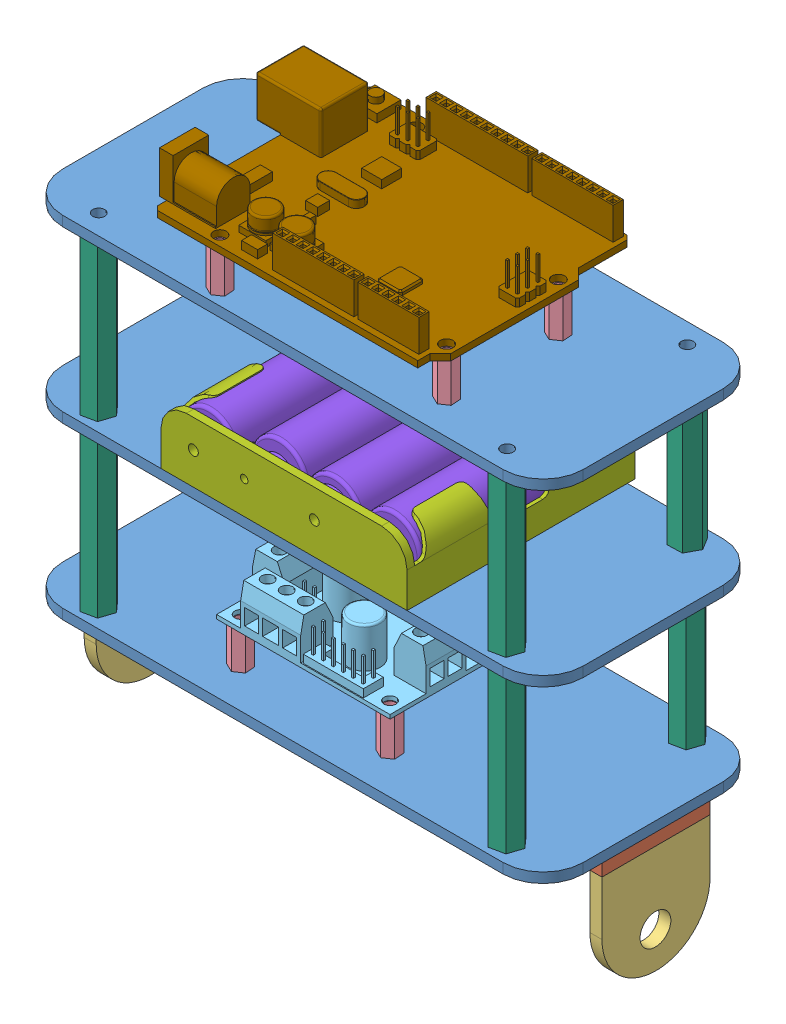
SolidWorks assembly robot.SLDASM, configuration Default (file format 9000). Lengths in mm.
Overall size (130 139.6 56.9).
54 component instances, 17 part files, 65 mates.
Components (placement in the parent):
- bed-2.5mm-1: bed-2.5mm.SLDPRT [Default] at (33.0822 58.8238 113.2124) size (130 2.5 55)
- bracket part1-1: bracket part1.SLDPRT [Default] at (-11.9178 55.8238 111.8401) x (0 1 0) z (0 0 1) size (3 40 27)
- bracketpart2-1: bracketpart2.SLDPRT [Default] at (-31.9178 42.3238 111.8401) size (3 27 27)
- bracket part1-2: bracket part1.SLDPRT [Default] at (78.0822 55.8238 112.5269) x (0 1 0) z (0 0 -1) size (3 40 27)
- bracketpart2-2: bracketpart2.SLDPRT [Default] at (95.0822 42.3238 112.5269) size (3 27 27)
- piller-10mm-1: piller-10mm.SLDPRT [Default] at (49.77 71.3238 130.8308) x (1 0 0) z (0 -1 0) size (4.51 5 10)
- piller-10mm-2: piller-10mm.SLDPRT [Default] at (49.77 71.3238 93.5308) x (1 0 0) z (0 -1 0) size (4.51 5 10)
- piller-10mm-3: piller-10mm.SLDPRT [Default] at (87.07 71.3238 130.8308) x (1 0 0) z (0 -1 0) size (4.51 5 10)
- piller-10mm-4: piller-10mm.SLDPRT [Default] at (87.07 71.3238 93.5308) x (1 0 0) z (0 -1 0) size (4.51 5 10)
- L298N-1: L298N.SLDPRT [Predeterminado] at (52.9557 71.3238 90.5308) size (43.3 25 43.3)
- piller-40mm-1: piller-40mm.SLDPRT [Default] at (-17.9178 61.3238 90.7124) size (7.34 40 7.12)
- piller-40mm-2: piller-40mm.SLDPRT [Default] at (84.0822 61.3238 90.7124) size (7.34 40 7.12)
- piller-40mm-3: piller-40mm.SLDPRT [Default] at (-17.9178 61.3238 135.7124) size (7.34 40 7.12)
- piller-40mm-4: piller-40mm.SLDPRT [Default] at (84.0822 61.3238 135.7124) size (7.34 40 7.12)
- bed-2.5mm-2: bed-2.5mm.SLDPRT [Default] at (33.0822 101.3238 113.2124) size (130 2.5 55)
- User Library-R6_AA_UM3-1_5V_holder4AA-1: User Library-R6_AA_UM3-1_5V_holder4AA.SLDPRT [4AA] at (33.3637 103.8238 112.2644) x (0 0 1) z (0 1 0) size (56.9 61.47 15.11)
- Batteria ricaricabile stilo-1: Batteria ricaricabile stilo.SLDPRT [Default] at (55.7792 111.8248 136.1244) x (1 0 0) z (0 0 -1) size (13.97 13.97 50.04)
- Batteria ricaricabile stilo-3: Batteria ricaricabile stilo.SLDPRT [Default] at (40.7932 111.8248 88.4044) x (0.96512 -0.261806 0) z (0 0 1) size (13.97 13.97 50.04)
- Batteria ricaricabile stilo-4: Batteria ricaricabile stilo.SLDPRT [Default] at (25.8707 111.8248 134.6244) x (0.945697 -0.32505 0) z (0 0 -1) size (13.97 13.97 50.04)
- Batteria ricaricabile stilo-5: Batteria ricaricabile stilo.SLDPRT [Default] at (10.5037 111.8248 89.4044) size (13.97 13.97 50.04)
- piller-40mm-5: piller-40mm.SLDPRT [Default] at (-17.9178 103.8238 90.7124) size (7.34 40 7.12)
- piller-40mm-6: piller-40mm.SLDPRT [Default] at (84.0822 103.8238 135.7124) size (7.34 40 7.12)
- piller-40mm-7: piller-40mm.SLDPRT [Default] at (84.0822 103.8238 90.7124) x (0.983984 0 0.178259) z (-0.178259 0 0.983984) size (7.34 40 7.12)
- piller-40mm-8: piller-40mm.SLDPRT [Default] at (-17.9178 103.8238 135.7124) size (7.34 40 7.12)
- bed-2.5mm-3: bed-2.5mm.SLDPRT [Default] at (33.0822 143.8238 113.2124) size (130 2.5 55)
- piller-10mm-5: piller-10mm.SLDPRT [Default] at (51.7887 156.3238 89.1251) x (1 0 0) z (0 -1 0) size (4.51 5 10)
- piller-10mm-6: piller-10mm.SLDPRT [Default] at (102.5887 156.3238 104.3251) x (1 0 0) z (0 -1 0) size (4.51 5 10)
- piller-10mm-7: piller-10mm.SLDPRT [Default] at (102.5887 156.3238 132.2251) x (1 0 0) z (0 -1 0) size (4.51 5 10)
- piller-10mm-8: piller-10mm.SLDPRT [Default] at (50.6887 156.3238 136.9251) x (1 0 0) z (0 -1 0) size (4.51 5 10)
- Arduino UNO-1: Arduino UNO.SLDPRT [Default] at (32.4743 156.3238 112.7751) size (74.8 12.1 53.3)
- MPU 6050 IMU-1: MPU 6050 IMU.SLDASM [Default] at (28.7297 157.964 85.6114)
  - Base-1: Base.SLDPRT [Default] at (7.2489 10.9584 16.5726) (suppressed, hidden)
  - pin header-1: pin header.SLDPRT [Default] at (16.0246 10.3869 9.8416) x (-1 0 0) z (0 0 1) (suppressed, hidden)
  - pin header-2: pin header.SLDPRT [Default] at (13.4846 10.3869 9.8416) x (-1 0 0) z (0 0 1) (suppressed, hidden)
  - pin header-3: pin header.SLDPRT [Default] at (10.9446 10.3869 9.8416) x (-1 0 0) z (0 0 1) (suppressed, hidden)
  - pin header-4: pin header.SLDPRT [Default] at (8.4046 10.3869 9.8416) x (-1 0 0) z (0 0 1) (suppressed, hidden)
  - pin header-5: pin header.SLDPRT [Default] at (5.8646 10.3869 9.8416) x (-1 0 0) z (0 0 1) (suppressed, hidden)
  - pin header-6: pin header.SLDPRT [Default] at (3.3246 10.3869 9.8416) x (-1 0 0) z (0 0 1) (suppressed, hidden)
  - pin header-7: pin header.SLDPRT [Default] at (0.7846 10.3869 9.8416) x (-1 0 0) z (0 0 1) (suppressed, hidden)
  - pin header-8: pin header.SLDPRT [Default] at (-1.7554 10.3869 9.8416) x (-1 0 0) z (0 0 1) (suppressed, hidden)
  - sensor chip-1: sensor chip.SLDPRT [Default] at (7.2489 11.5499 17.4466) (suppressed, hidden)
  - S2NH chip-1: S2NH chip.SLDPRT [Default] at (16.1026 12.3799 16.5726) (suppressed, hidden)
  - Resistor small-3: Resistor small.SLDPRT [Default] at (16.1026 11.5314 19.3726) (suppressed, hidden)
  - Resistor small-4: Resistor small.SLDPRT [Default] at (13.9776 11.5314 15.6976) x (0 0 -1) z (1 0 0) (suppressed, hidden)
  - Resistor small black-3: Resistor small black.SLDPRT [Default] at (12.6276 11.5299 15.6976) x (0 0 1) z (-1 0 0) (suppressed, hidden)
  - Resistor small black-4: Resistor small black.SLDPRT [Default] at (11.1276 11.5299 15.6976) x (0 0 1) z (-1 0 0) (suppressed, hidden)
  - Resistor small-5: Resistor small.SLDPRT [Default] at (12.6276 11.5314 19.3216) x (0 0 -1) z (1 0 0) (suppressed, hidden)
  - Resistor small-6: Resistor small.SLDPRT [Default] at (11.1276 11.5314 19.3216) x (0 0 -1) z (1 0 0) (suppressed, hidden)
  - Resistor small-7: Resistor small.SLDPRT [Default] at (3.3702 11.5314 19.3216) x (0 0 -1) z (1 0 0) (suppressed, hidden)
  - Resistor small black-5: Resistor small black.SLDPRT [Default] at (1.8702 11.5299 15.6968) x (0 0 -1) z (1 0 0) (suppressed, hidden)
  - Resistor small-8: Resistor small.SLDPRT [Default] at (3.3702 11.5314 15.6976) x (0 0 1) z (-1 0 0) (suppressed, hidden)
  - Small LED-1: Small LED.SLDPRT [Default] at (0.3652 11.5299 15.6976) (suppressed, hidden)
  - Resistor small black-6: Resistor small black.SLDPRT [Default] at (1.8702 11.5299 19.3216) x (0 0 1) z (-1 0 0) (suppressed, hidden)
  - Resistor black-1: Resistor black.SLDPRT [Default] at (7.2489 12.3799 21.6466) (suppressed, hidden)
Mates (geometry in assembly coordinates):
- Coincident1: coincident anti-aligned: plane of bed-2.5mm-1 through (33.0822 58.8238 113.2124) normal (0 -1 0); plane of bracket part1-1 through (-11.9178 58.8238 111.8401) normal (0 1 0)
- Coincident2: coincident aligned: plane of bed-2.5mm-1 through (-31.9178 61.3238 85.7124) normal (-1 0 0); plane of bracket part1-1 through (-31.9178 58.8238 125.3401) normal (-1 0 0)
- Coincident3: coincident anti-aligned: plane of bracket part1-1 through (-11.9178 55.8238 111.8401) normal (0 -1 0); plane of bracketpart2-1 through (-28.9178 55.8238 125.3401) normal (0 1 0)
- Coincident4: coincident aligned: plane of bracket part1-1 through (-31.9178 58.8238 125.3401) normal (-1 0 0); plane of bracketpart2-1 through (-31.9178 42.3238 111.8401) normal (-1 0 0)
- Coincident5: coincident aligned: plane of bracket part1-1 through (-31.9178 58.8238 98.3401) normal (0 0 -1); plane of bracketpart2-1 through (-28.9178 55.8238 98.3401) normal (0 0 -1)
- Coincident6: coincident anti-aligned: plane of bed-2.5mm-1 through (33.0822 58.8238 113.2124) normal (0 -1 0); plane of bracket part1-2 through (78.0822 58.8238 112.5269) normal (0 1 0)
- Coincident7: coincident aligned: plane of bed-2.5mm-1 through (98.0822 61.3238 85.7124) normal (1 0 0); plane of bracket part1-2 through (98.0822 58.8238 99.0269) normal (1 0 0)
- Coincident8: coincident anti-aligned: plane of bracket part1-2 through (78.0822 55.8238 112.5269) normal (0 -1 0); plane of bracketpart2-2 through (98.0822 55.8238 126.0269) normal (0 1 0)
- Coincident9: coincident aligned: plane of bracket part1-2 through (98.0822 58.8238 99.0269) normal (1 0 0); plane of bracketpart2-2 through (98.0822 42.3238 112.5269) normal (1 0 0)
- Coincident10: coincident aligned: plane of bracket part1-2 through (98.0822 58.8238 126.0269) normal (0 0 1); plane of bracketpart2-2 through (98.0822 42.3238 126.0269) normal (0 0 1)
- Coincident11: coincident anti-aligned: plane of bed-2.5mm-1 through (33.0822 61.3238 113.2124) normal (0 1 0); plane of piller-10mm-4 through (87.07 61.3238 93.5308) normal (0 -1 0)
- Coincident12: coincident anti-aligned: plane of bed-2.5mm-1 through (33.0822 61.3238 113.2124) normal (0 1 0); plane of piller-10mm-3 through (87.07 61.3238 130.8308) normal (0 -1 0)
- Coincident13: coincident anti-aligned: plane of bed-2.5mm-1 through (33.0822 61.3238 113.2124) normal (0 1 0); plane of piller-10mm-1 through (49.77 61.3238 130.8308) normal (0 -1 0)
- Coincident14: coincident anti-aligned: plane of bed-2.5mm-1 through (33.0822 61.3238 113.2124) normal (0 1 0); plane of piller-10mm-2 through (49.77 61.3238 93.5308) normal (0 -1 0)
- Coincident15: coincident anti-aligned: plane of piller-10mm-1 through (49.77 71.3238 130.8308) normal (0 1 0); plane of L298N-1 through (-16.4657 71.3238 112.1808) normal (0 -1 0)
- Concentric1: concentric anti-aligned: circle of piller-10mm-1; circle of L298N-1
- Concentric2: concentric anti-aligned: circle of piller-10mm-3; circle of L298N-1
- Concentric3: concentric anti-aligned: circle of piller-10mm-4; circle of L298N-1
- Concentric4: concentric anti-aligned: circle of piller-10mm-2; circle of L298N-1
- Coincident16: coincident anti-aligned: plane of bed-2.5mm-1 through (33.0822 61.3238 113.2124) normal (0 1 0); plane of piller-40mm-4 through (84.0822 61.3238 135.7124) normal (0 -1 0)
- Concentric5: concentric anti-aligned: circle of bed-2.5mm-1; circle of piller-40mm-4
- Concentric6: concentric anti-aligned: cylinder of bed-2.5mm-1 through (84.0822 66.8238 90.7124) axis (0 -1 0) radius 1.5; circle of piller-40mm-2
- Coincident17: coincident anti-aligned: plane of bed-2.5mm-1 through (33.0822 61.3238 113.2124) normal (0 1 0); plane of piller-40mm-2 through (84.0822 61.3238 90.7124) normal (0 -1 0)
- Concentric7: concentric anti-aligned: circle of bed-2.5mm-1; circle of piller-40mm-3
- Coincident18: coincident anti-aligned: plane of bed-2.5mm-1 through (33.0822 61.3238 113.2124) normal (0 1 0); plane of piller-40mm-3 through (-17.9178 61.3238 135.7124) normal (0 -1 0)
- Concentric8: concentric anti-aligned: circle of bed-2.5mm-1; circle of piller-40mm-1
- Coincident19: coincident anti-aligned: plane of bed-2.5mm-1 through (33.0822 61.3238 113.2124) normal (0 1 0); plane of piller-40mm-1 through (-17.9178 61.3238 90.7124) normal (0 -1 0)
- Coincident20: coincident anti-aligned: plane of piller-40mm-4 through (84.0822 101.3238 135.7124) normal (0 1 0); plane of bed-2.5mm-2 through (33.0822 101.3238 113.2124) normal (0 -1 0)
- Concentric9: concentric anti-aligned: circle of piller-40mm-4; circle of bed-2.5mm-2
- Concentric10: concentric anti-aligned: circle of piller-40mm-3; circle of bed-2.5mm-2
- Coincident21: coincident anti-aligned: plane of bed-2.5mm-2 through (33.0822 103.8238 113.2124) normal (0 1 0); plane of User Library-R6_AA_UM3-1_5V_holder4AA-1 through (2.6297 103.8238 83.8164) normal (0 -1 0)
- Coincident22: coincident aligned: plane of bed-2.5mm-2 through (-31.9178 103.8238 140.7124) normal (0 0 1); plane of User Library-R6_AA_UM3-1_5V_holder4AA-1 through (64.0977 118.9368 140.7124) normal (0 0 1)
- Tangent1: tangent anti-aligned: plane of User Library-R6_AA_UM3-1_5V_holder4AA-1 through (63.2087 104.8398 85.7214) normal (0 1 0); cylinder of Batteria ricaricabile stilo-1 through (55.7792 111.8248 88.7534) axis (0 0 1) radius 6.985
- Tangent2: tangent anti-aligned: plane of User Library-R6_AA_UM3-1_5V_holder4AA-1 through (48.7942 -499896.1762 85.7214) normal (1 0 0); cylinder of Batteria ricaricabile stilo-1 through (55.7792 111.8248 88.7534) axis (0 0 1) radius 6.985
- Tangent5: tangent anti-aligned: plane of User Library-R6_AA_UM3-1_5V_holder4AA-1 through (63.2087 104.8398 85.7214) normal (0 1 0); cylinder of Batteria ricaricabile stilo-1 through (55.7792 111.8248 88.7534) axis (0 0 1) radius 6.985
- Coincident23: coincident anti-aligned: circle of User Library-R6_AA_UM3-1_5V_holder4AA-1; plane of Batteria ricaricabile stilo-1 through (55.7792 111.8248 86.7214) normal (0 0 -1)
- Tangent8: tangent: torus of User Library-R6_AA_UM3-1_5V_holder4AA-1; plane of Batteria ricaricabile stilo-3 through (40.7932 111.8248 137.8074) normal (0 0 1)
- Tangent9: tangent anti-aligned: plane of User Library-R6_AA_UM3-1_5V_holder4AA-1 through (47.7782 -499896.1762 85.7214) normal (-1 0 0); cylinder of Batteria ricaricabile stilo-3 through (40.7932 111.8248 135.7754) axis (0 0 -1) radius 6.985
- Tangent10: tangent anti-aligned: plane of User Library-R6_AA_UM3-1_5V_holder4AA-1 through (63.2087 104.8398 85.7214) normal (0 1 0); cylinder of Batteria ricaricabile stilo-3 through (40.7932 111.8248 135.7754) axis (0 0 -1) radius 6.985
- Tangent16: tangent: torus of User Library-R6_AA_UM3-1_5V_holder4AA-1; plane of Batteria ricaricabile stilo-4 through (25.8707 111.8248 85.2214) normal (0 0 -1)
- Tangent18: tangent anti-aligned: plane of User Library-R6_AA_UM3-1_5V_holder4AA-1 through (3.5187 104.8398 85.7214) normal (0 1 0); cylinder of Batteria ricaricabile stilo-4 through (25.8707 111.8248 87.2534) axis (0 0 1) radius 6.985
- Tangent19: tangent anti-aligned: plane of User Library-R6_AA_UM3-1_5V_holder4AA-1 through (32.8557 104.8398 85.7214) normal (-1 0 0); cylinder of Batteria ricaricabile stilo-4 through (25.8707 111.8248 87.2534) axis (0 0 1) radius 6.985
- Coincident27: coincident anti-aligned: circle of User Library-R6_AA_UM3-1_5V_holder4AA-1; plane of Batteria ricaricabile stilo-5 through (10.5037 111.8248 138.8074) normal (0 0 1)
- Tangent20: tangent anti-aligned: plane of User Library-R6_AA_UM3-1_5V_holder4AA-1 through (3.5187 104.8398 85.7214) normal (0 1 0); cylinder of Batteria ricaricabile stilo-5 through (10.5037 111.8248 136.7754) axis (0 0 -1) radius 6.985
- Tangent21: tangent anti-aligned: plane of User Library-R6_AA_UM3-1_5V_holder4AA-1 through (3.5187 112.5868 85.7214) normal (1 0 0); cylinder of Batteria ricaricabile stilo-5 through (10.5037 111.8248 136.7754) axis (0 0 -1) radius 6.985
- Concentric11: concentric anti-aligned: circle of bed-2.5mm-2; circle of piller-40mm-7
- Coincident28: coincident anti-aligned: plane of bed-2.5mm-2 through (33.0822 103.8238 113.2124) normal (0 1 0); plane of piller-40mm-7 through (84.0822 103.8238 90.7124) normal (0 -1 0)
- Concentric12: concentric anti-aligned: circle of bed-2.5mm-2; circle of piller-40mm-6
- Coincident29: coincident anti-aligned: plane of bed-2.5mm-2 through (33.0822 103.8238 113.2124) normal (0 1 0); plane of piller-40mm-6 through (84.0822 103.8238 135.7124) normal (0 -1 0)
- Concentric13: concentric anti-aligned: circle of bed-2.5mm-2; circle of piller-40mm-5
- Coincident30: coincident anti-aligned: plane of bed-2.5mm-2 through (33.0822 103.8238 113.2124) normal (0 1 0); plane of piller-40mm-5 through (-17.9178 103.8238 90.7124) normal (0 -1 0)
- Concentric14: concentric anti-aligned: circle of bed-2.5mm-2; circle of piller-40mm-8
- Coincident31: coincident anti-aligned: plane of bed-2.5mm-2 through (33.0822 103.8238 113.2124) normal (0 1 0); plane of piller-40mm-8 through (-17.9178 103.8238 135.7124) normal (0 -1 0)
- Coincident32: coincident anti-aligned: plane of piller-40mm-6 through (84.0822 143.8238 135.7124) normal (0 1 0); plane of bed-2.5mm-3 through (33.0822 143.8238 113.2124) normal (0 -1 0)
- Concentric15: concentric anti-aligned: circle of piller-40mm-6; circle of bed-2.5mm-3
- Concentric16: concentric anti-aligned: circle of piller-40mm-8; circle of bed-2.5mm-3
- Coincident33: coincident anti-aligned: plane of bed-2.5mm-3 through (33.0822 146.3238 113.2124) normal (0 1 0); plane of piller-10mm-5 through (51.7887 146.3238 89.1251) normal (0 -1 0)
- Coincident34: coincident anti-aligned: plane of bed-2.5mm-3 through (33.0822 146.3238 113.2124) normal (0 1 0); plane of piller-10mm-6 through (102.5887 146.3238 104.3251) normal (0 -1 0)
- Coincident35: coincident anti-aligned: plane of bed-2.5mm-3 through (33.0822 146.3238 113.2124) normal (0 1 0); plane of piller-10mm-8 through (50.6887 146.3238 136.9251) normal (0 -1 0)
- Coincident36: coincident anti-aligned: plane of bed-2.5mm-3 through (33.0822 146.3238 113.2124) normal (0 1 0); plane of piller-10mm-7 through (102.5887 146.3238 132.2251) normal (0 -1 0)
- Coincident37: coincident anti-aligned: plane of piller-10mm-7 through (102.5887 156.3238 132.2251) normal (0 1 0); plane of Arduino UNO-1 through (65.4743 156.3238 86.1251) normal (0 -1 0)
- Concentric17: concentric anti-aligned: circle of piller-10mm-7; circle of Arduino UNO-1
- Concentric18: concentric anti-aligned: circle of piller-10mm-6; circle of Arduino UNO-1
- Concentric19: concentric anti-aligned: circle of piller-10mm-8; circle of Arduino UNO-1
- Concentric20: concentric anti-aligned: circle of piller-10mm-5; circle of Arduino UNO-1
